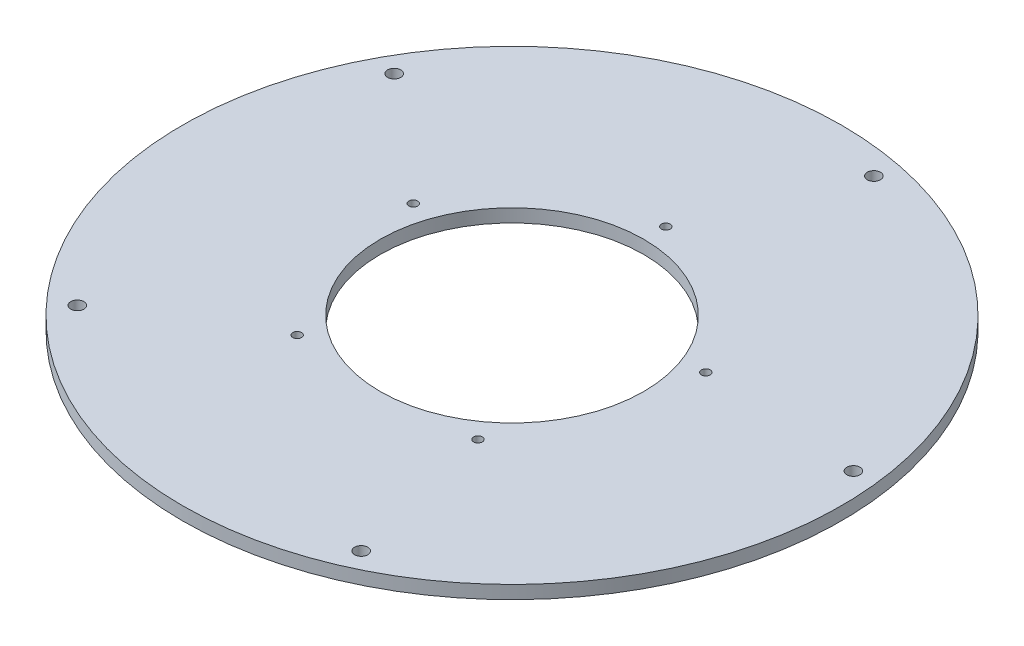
ISO-10303-21;
HEADER;
FILE_DESCRIPTION(('STEP AP214'),'2;1');
FILE_NAME('part.step','',(''),(''),'','','');
FILE_SCHEMA(('AUTOMOTIVE_DESIGN { 1 0 10303 214 1 1 1 1 }'));
ENDSEC;
DATA;
#1=APPLICATION_CONTEXT('core data for automotive mechanical design processes');
#2=APPLICATION_PROTOCOL_DEFINITION('international standard','automotive_design',2000,#1);
#3=PRODUCT_CONTEXT('',#1,'mechanical');
#4=PRODUCT('Part','Part','',(#3));
#5=PRODUCT_RELATED_PRODUCT_CATEGORY('part','',(#4));
#6=PRODUCT_DEFINITION_FORMATION('','',#4);
#7=PRODUCT_DEFINITION_CONTEXT('part definition',#1,'design');
#8=PRODUCT_DEFINITION('design','',#6,#7);
#9=PRODUCT_DEFINITION_SHAPE('','',#8);
#10=(LENGTH_UNIT() NAMED_UNIT(*) SI_UNIT(.MILLI.,.METRE.));
#11=(NAMED_UNIT(*) PLANE_ANGLE_UNIT() SI_UNIT($,.RADIAN.));
#12=(NAMED_UNIT(*) SI_UNIT($,.STERADIAN.) SOLID_ANGLE_UNIT());
#13=UNCERTAINTY_MEASURE_WITH_UNIT(LENGTH_MEASURE(1.E-05),#10,'distance_accuracy_value','');
#14=(GEOMETRIC_REPRESENTATION_CONTEXT(3) GLOBAL_UNCERTAINTY_ASSIGNED_CONTEXT((#13)) GLOBAL_UNIT_ASSIGNED_CONTEXT((#10,
#11,#12)) REPRESENTATION_CONTEXT('',''));
#15=CARTESIAN_POINT('',(0.,0.,0.));
#16=DIRECTION('',(0.,0.,1.));
#17=DIRECTION('',(1.,0.,0.));
#18=AXIS2_PLACEMENT_3D('',#15,#16,#17);
#19=CARTESIAN_POINT('',(0.,3.,0.));
#20=DIRECTION('',(0.,1.,0.));
#21=DIRECTION('',(0.,0.,1.));
#22=AXIS2_PLACEMENT_3D('',#19,#20,#21);
#23=PLANE('',#22);
#24=CARTESIAN_POINT('',(-33.2869780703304,3.,-10.8155948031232));
#25=DIRECTION('',(0.,1.,0.));
#26=DIRECTION('',(0.,0.,1.));
#27=AXIS2_PLACEMENT_3D('',#24,#25,#26);
#28=CIRCLE('',#27,1.00000000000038);
#29=CARTESIAN_POINT('',(-33.2869780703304,3.,-9.81559480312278));
#30=VERTEX_POINT('',#29);
#31=EDGE_CURVE('E95',#30,#30,#28,.T.);
#32=ORIENTED_EDGE('',*,*,#31,.F.);
#33=EDGE_LOOP('',(#32));
#34=FACE_BOUND('',#33,.T.);
#35=CARTESIAN_POINT('',(-20.5724838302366,3.,28.3155948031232));
#36=DIRECTION('',(0.,1.,0.));
#37=DIRECTION('',(0.,0.,1.));
#38=AXIS2_PLACEMENT_3D('',#35,#36,#37);
#39=CIRCLE('',#38,1.0000000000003);
#40=CARTESIAN_POINT('',(-20.5724838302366,3.,29.3155948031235));
#41=VERTEX_POINT('',#40);
#42=EDGE_CURVE('E83',#41,#41,#39,.T.);
#43=ORIENTED_EDGE('',*,*,#42,.F.);
#44=EDGE_LOOP('',(#43));
#45=FACE_BOUND('',#44,.T.);
#46=CARTESIAN_POINT('',(20.5724838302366,3.,28.3155948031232));
#47=DIRECTION('',(0.,1.,0.));
#48=DIRECTION('',(0.,0.,1.));
#49=AXIS2_PLACEMENT_3D('',#46,#47,#48);
#50=CIRCLE('',#49,1.0000000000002);
#51=CARTESIAN_POINT('',(20.5724838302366,3.,29.3155948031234));
#52=VERTEX_POINT('',#51);
#53=EDGE_CURVE('E71',#52,#52,#50,.T.);
#54=ORIENTED_EDGE('',*,*,#53,.F.);
#55=EDGE_LOOP('',(#54));
#56=FACE_BOUND('',#55,.T.);
#57=CARTESIAN_POINT('',(33.2869780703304,3.,-10.8155948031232));
#58=DIRECTION('',(0.,1.,0.));
#59=DIRECTION('',(0.,0.,1.));
#60=AXIS2_PLACEMENT_3D('',#57,#58,#59);
#61=CIRCLE('',#60,1.00000000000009);
#62=CARTESIAN_POINT('',(33.2869780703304,3.,-9.81559480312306));
#63=VERTEX_POINT('',#62);
#64=EDGE_CURVE('E59',#63,#63,#61,.T.);
#65=ORIENTED_EDGE('',*,*,#64,.F.);
#66=EDGE_LOOP('',(#65));
#67=FACE_BOUND('',#66,.T.);
#68=CARTESIAN_POINT('',(0.,3.,-35.));
#69=DIRECTION('',(0.,1.,0.));
#70=DIRECTION('',(0.,0.,1.));
#71=AXIS2_PLACEMENT_3D('',#68,#69,#70);
#72=CIRCLE('',#71,1.);
#73=CARTESIAN_POINT('',(0.,3.,-34.));
#74=VERTEX_POINT('',#73);
#75=EDGE_CURVE('E47',#74,#74,#72,.T.);
#76=ORIENTED_EDGE('',*,*,#75,.F.);
#77=EDGE_LOOP('',(#76));
#78=FACE_BOUND('',#77,.T.);
#79=CARTESIAN_POINT('',(0.,3.,0.));
#80=DIRECTION('',(0.,1.,0.));
#81=DIRECTION('',(0.,0.,1.));
#82=AXIS2_PLACEMENT_3D('',#79,#80,#81);
#83=CIRCLE('',#82,75.);
#84=CARTESIAN_POINT('',(0.,3.,75.));
#85=VERTEX_POINT('',#84);
#86=EDGE_CURVE('E10',#85,#85,#83,.T.);
#87=ORIENTED_EDGE('',*,*,#86,.T.);
#88=EDGE_LOOP('',(#87));
#89=FACE_BOUND('',#88,.T.);
#90=CARTESIAN_POINT('',(0.,3.,0.));
#91=DIRECTION('',(0.,1.,0.));
#92=DIRECTION('',(0.,0.,1.));
#93=AXIS2_PLACEMENT_3D('',#90,#91,#92);
#94=CIRCLE('',#93,30.);
#95=CARTESIAN_POINT('',(0.,3.,30.));
#96=VERTEX_POINT('',#95);
#97=EDGE_CURVE('E42',#96,#96,#94,.T.);
#98=ORIENTED_EDGE('',*,*,#97,.F.);
#99=EDGE_LOOP('',(#98));
#100=FACE_BOUND('',#99,.T.);
#101=CARTESIAN_POINT('',(13.7,3.,-68.6462671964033));
#102=DIRECTION('',(0.,1.,0.));
#103=DIRECTION('',(0.,0.,1.));
#104=AXIS2_PLACEMENT_3D('',#101,#102,#103);
#105=CIRCLE('',#104,1.5);
#106=CARTESIAN_POINT('',(13.7,3.,-67.1462671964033));
#107=VERTEX_POINT('',#106);
#108=EDGE_CURVE('E53',#107,#107,#105,.T.);
#109=ORIENTED_EDGE('',*,*,#108,.F.);
#110=EDGE_LOOP('',(#109));
#111=FACE_BOUND('',#110,.T.);
#112=CARTESIAN_POINT('',(69.5200125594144,3.,-8.18338889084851));
#113=DIRECTION('',(0.,1.,0.));
#114=DIRECTION('',(0.,0.,1.));
#115=AXIS2_PLACEMENT_3D('',#112,#113,#114);
#116=CIRCLE('',#115,1.5);
#117=CARTESIAN_POINT('',(69.5200125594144,3.,-6.68338889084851));
#118=VERTEX_POINT('',#117);
#119=EDGE_CURVE('E65',#118,#118,#116,.T.);
#120=ORIENTED_EDGE('',*,*,#119,.F.);
#121=EDGE_LOOP('',(#120));
#122=FACE_BOUND('',#121,.T.);
#123=CARTESIAN_POINT('',(29.2657306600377,3.,63.5886547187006));
#124=DIRECTION('',(0.,1.,0.));
#125=DIRECTION('',(0.,0.,1.));
#126=AXIS2_PLACEMENT_3D('',#123,#124,#125);
#127=CIRCLE('',#126,1.5);
#128=CARTESIAN_POINT('',(29.2657306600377,3.,65.0886547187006));
#129=VERTEX_POINT('',#128);
#130=EDGE_CURVE('E77',#129,#129,#127,.T.);
#131=ORIENTED_EDGE('',*,*,#130,.F.);
#132=EDGE_LOOP('',(#131));
#133=FACE_BOUND('',#132,.T.);
#134=CARTESIAN_POINT('',(-51.4327963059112,3.,47.4833388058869));
#135=DIRECTION('',(0.,1.,0.));
#136=DIRECTION('',(0.,0.,1.));
#137=AXIS2_PLACEMENT_3D('',#134,#135,#136);
#138=CIRCLE('',#137,1.5);
#139=CARTESIAN_POINT('',(-51.4327963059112,3.,48.9833388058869));
#140=VERTEX_POINT('',#139);
#141=EDGE_CURVE('E89',#140,#140,#138,.T.);
#142=ORIENTED_EDGE('',*,*,#141,.F.);
#143=EDGE_LOOP('',(#142));
#144=FACE_BOUND('',#143,.T.);
#145=CARTESIAN_POINT('',(-61.0529469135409,3.,-34.2423374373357));
#146=DIRECTION('',(0.,1.,0.));
#147=DIRECTION('',(0.,0.,1.));
#148=AXIS2_PLACEMENT_3D('',#145,#146,#147);
#149=CIRCLE('',#148,1.5);
#150=CARTESIAN_POINT('',(-61.0529469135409,3.,-32.7423374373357));
#151=VERTEX_POINT('',#150);
#152=EDGE_CURVE('E101',#151,#151,#149,.T.);
#153=ORIENTED_EDGE('',*,*,#152,.F.);
#154=EDGE_LOOP('',(#153));
#155=FACE_BOUND('',#154,.T.);
#156=ADVANCED_FACE('F31',(#34,#45,#56,#67,#78,#89,#100,#111,#122,#133,#144,#155),#23,.T.);
#157=CARTESIAN_POINT('',(0.,0.,0.));
#158=DIRECTION('',(0.,1.,0.));
#159=DIRECTION('',(0.,0.,1.));
#160=AXIS2_PLACEMENT_3D('',#157,#158,#159);
#161=PLANE('',#160);
#162=CARTESIAN_POINT('',(-33.2869780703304,0.,-10.8155948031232));
#163=DIRECTION('',(0.,1.,0.));
#164=DIRECTION('',(0.,0.,1.));
#165=AXIS2_PLACEMENT_3D('',#162,#163,#164);
#166=CIRCLE('',#165,1.00000000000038);
#167=CARTESIAN_POINT('',(-33.2869780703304,0.,-9.81559480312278));
#168=VERTEX_POINT('',#167);
#169=EDGE_CURVE('E98',#168,#168,#166,.T.);
#170=ORIENTED_EDGE('',*,*,#169,.T.);
#171=EDGE_LOOP('',(#170));
#172=FACE_BOUND('',#171,.T.);
#173=CARTESIAN_POINT('',(-20.5724838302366,0.,28.3155948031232));
#174=DIRECTION('',(0.,1.,0.));
#175=DIRECTION('',(0.,0.,1.));
#176=AXIS2_PLACEMENT_3D('',#173,#174,#175);
#177=CIRCLE('',#176,1.0000000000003);
#178=CARTESIAN_POINT('',(-20.5724838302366,0.,29.3155948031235));
#179=VERTEX_POINT('',#178);
#180=EDGE_CURVE('E86',#179,#179,#177,.T.);
#181=ORIENTED_EDGE('',*,*,#180,.T.);
#182=EDGE_LOOP('',(#181));
#183=FACE_BOUND('',#182,.T.);
#184=CARTESIAN_POINT('',(20.5724838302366,0.,28.3155948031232));
#185=DIRECTION('',(0.,1.,0.));
#186=DIRECTION('',(0.,0.,1.));
#187=AXIS2_PLACEMENT_3D('',#184,#185,#186);
#188=CIRCLE('',#187,1.0000000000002);
#189=CARTESIAN_POINT('',(20.5724838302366,0.,29.3155948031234));
#190=VERTEX_POINT('',#189);
#191=EDGE_CURVE('E74',#190,#190,#188,.T.);
#192=ORIENTED_EDGE('',*,*,#191,.T.);
#193=EDGE_LOOP('',(#192));
#194=FACE_BOUND('',#193,.T.);
#195=CARTESIAN_POINT('',(33.2869780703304,0.,-10.8155948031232));
#196=DIRECTION('',(0.,1.,0.));
#197=DIRECTION('',(0.,0.,1.));
#198=AXIS2_PLACEMENT_3D('',#195,#196,#197);
#199=CIRCLE('',#198,1.00000000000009);
#200=CARTESIAN_POINT('',(33.2869780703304,0.,-9.81559480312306));
#201=VERTEX_POINT('',#200);
#202=EDGE_CURVE('E62',#201,#201,#199,.T.);
#203=ORIENTED_EDGE('',*,*,#202,.T.);
#204=EDGE_LOOP('',(#203));
#205=FACE_BOUND('',#204,.T.);
#206=CARTESIAN_POINT('',(0.,0.,-35.));
#207=DIRECTION('',(0.,1.,0.));
#208=DIRECTION('',(0.,0.,1.));
#209=AXIS2_PLACEMENT_3D('',#206,#207,#208);
#210=CIRCLE('',#209,1.);
#211=CARTESIAN_POINT('',(0.,0.,-34.));
#212=VERTEX_POINT('',#211);
#213=EDGE_CURVE('E50',#212,#212,#210,.T.);
#214=ORIENTED_EDGE('',*,*,#213,.T.);
#215=EDGE_LOOP('',(#214));
#216=FACE_BOUND('',#215,.T.);
#217=CARTESIAN_POINT('',(0.,0.,0.));
#218=DIRECTION('',(0.,1.,0.));
#219=DIRECTION('',(0.,0.,1.));
#220=AXIS2_PLACEMENT_3D('',#217,#218,#219);
#221=CIRCLE('',#220,75.);
#222=CARTESIAN_POINT('',(0.,0.,75.));
#223=VERTEX_POINT('',#222);
#224=EDGE_CURVE('E35',#223,#223,#221,.T.);
#225=ORIENTED_EDGE('',*,*,#224,.F.);
#226=EDGE_LOOP('',(#225));
#227=FACE_BOUND('',#226,.T.);
#228=CARTESIAN_POINT('',(0.,0.,0.));
#229=DIRECTION('',(0.,1.,0.));
#230=DIRECTION('',(0.,0.,1.));
#231=AXIS2_PLACEMENT_3D('',#228,#229,#230);
#232=CIRCLE('',#231,30.);
#233=CARTESIAN_POINT('',(0.,0.,30.));
#234=VERTEX_POINT('',#233);
#235=EDGE_CURVE('E44',#234,#234,#232,.T.);
#236=ORIENTED_EDGE('',*,*,#235,.T.);
#237=EDGE_LOOP('',(#236));
#238=FACE_BOUND('',#237,.T.);
#239=CARTESIAN_POINT('',(13.7,0.,-68.6462671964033));
#240=DIRECTION('',(0.,1.,0.));
#241=DIRECTION('',(0.,0.,1.));
#242=AXIS2_PLACEMENT_3D('',#239,#240,#241);
#243=CIRCLE('',#242,1.5);
#244=CARTESIAN_POINT('',(13.7,0.,-67.1462671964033));
#245=VERTEX_POINT('',#244);
#246=EDGE_CURVE('E56',#245,#245,#243,.T.);
#247=ORIENTED_EDGE('',*,*,#246,.T.);
#248=EDGE_LOOP('',(#247));
#249=FACE_BOUND('',#248,.T.);
#250=CARTESIAN_POINT('',(69.5200125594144,0.,-8.18338889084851));
#251=DIRECTION('',(0.,1.,0.));
#252=DIRECTION('',(0.,0.,1.));
#253=AXIS2_PLACEMENT_3D('',#250,#251,#252);
#254=CIRCLE('',#253,1.5);
#255=CARTESIAN_POINT('',(69.5200125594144,0.,-6.68338889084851));
#256=VERTEX_POINT('',#255);
#257=EDGE_CURVE('E68',#256,#256,#254,.T.);
#258=ORIENTED_EDGE('',*,*,#257,.T.);
#259=EDGE_LOOP('',(#258));
#260=FACE_BOUND('',#259,.T.);
#261=CARTESIAN_POINT('',(29.2657306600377,0.,63.5886547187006));
#262=DIRECTION('',(0.,1.,0.));
#263=DIRECTION('',(0.,0.,1.));
#264=AXIS2_PLACEMENT_3D('',#261,#262,#263);
#265=CIRCLE('',#264,1.5);
#266=CARTESIAN_POINT('',(29.2657306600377,0.,65.0886547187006));
#267=VERTEX_POINT('',#266);
#268=EDGE_CURVE('E80',#267,#267,#265,.T.);
#269=ORIENTED_EDGE('',*,*,#268,.T.);
#270=EDGE_LOOP('',(#269));
#271=FACE_BOUND('',#270,.T.);
#272=CARTESIAN_POINT('',(-51.4327963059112,0.,47.4833388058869));
#273=DIRECTION('',(0.,1.,0.));
#274=DIRECTION('',(0.,0.,1.));
#275=AXIS2_PLACEMENT_3D('',#272,#273,#274);
#276=CIRCLE('',#275,1.5);
#277=CARTESIAN_POINT('',(-51.4327963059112,0.,48.9833388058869));
#278=VERTEX_POINT('',#277);
#279=EDGE_CURVE('E92',#278,#278,#276,.T.);
#280=ORIENTED_EDGE('',*,*,#279,.T.);
#281=EDGE_LOOP('',(#280));
#282=FACE_BOUND('',#281,.T.);
#283=CARTESIAN_POINT('',(-61.0529469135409,0.,-34.2423374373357));
#284=DIRECTION('',(0.,1.,0.));
#285=DIRECTION('',(0.,0.,1.));
#286=AXIS2_PLACEMENT_3D('',#283,#284,#285);
#287=CIRCLE('',#286,1.5);
#288=CARTESIAN_POINT('',(-61.0529469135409,0.,-32.7423374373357));
#289=VERTEX_POINT('',#288);
#290=EDGE_CURVE('E104',#289,#289,#287,.T.);
#291=ORIENTED_EDGE('',*,*,#290,.T.);
#292=EDGE_LOOP('',(#291));
#293=FACE_BOUND('',#292,.T.);
#294=ADVANCED_FACE('F114',(#172,#183,#194,#205,#216,#227,#238,#249,#260,#271,#282,#293),#161,.F.);
#295=CARTESIAN_POINT('',(0.,3.,0.));
#296=DIRECTION('',(0.,-1.,0.));
#297=DIRECTION('',(0.,0.,-1.));
#298=AXIS2_PLACEMENT_3D('',#295,#296,#297);
#299=CYLINDRICAL_SURFACE('',#298,75.);
#300=ORIENTED_EDGE('',*,*,#86,.F.);
#301=EDGE_LOOP('',(#300));
#302=FACE_BOUND('',#301,.T.);
#303=ORIENTED_EDGE('',*,*,#224,.T.);
#304=EDGE_LOOP('',(#303));
#305=FACE_BOUND('',#304,.T.);
#306=ADVANCED_FACE('F33',(#302,#305),#299,.T.);
#307=CARTESIAN_POINT('',(0.,3.,0.));
#308=DIRECTION('',(0.,-1.,0.));
#309=DIRECTION('',(0.,0.,-1.));
#310=AXIS2_PLACEMENT_3D('',#307,#308,#309);
#311=CYLINDRICAL_SURFACE('',#310,30.);
#312=ORIENTED_EDGE('',*,*,#97,.T.);
#313=EDGE_LOOP('',(#312));
#314=FACE_BOUND('',#313,.T.);
#315=ORIENTED_EDGE('',*,*,#235,.F.);
#316=EDGE_LOOP('',(#315));
#317=FACE_BOUND('',#316,.T.);
#318=ADVANCED_FACE('F124',(#314,#317),#311,.F.);
#319=CARTESIAN_POINT('',(0.,3.,-35.));
#320=DIRECTION('',(0.,-1.,0.));
#321=DIRECTION('',(0.,0.,-1.));
#322=AXIS2_PLACEMENT_3D('',#319,#320,#321);
#323=CYLINDRICAL_SURFACE('',#322,1.);
#324=ORIENTED_EDGE('',*,*,#75,.T.);
#325=EDGE_LOOP('',(#324));
#326=FACE_BOUND('',#325,.T.);
#327=ORIENTED_EDGE('',*,*,#213,.F.);
#328=EDGE_LOOP('',(#327));
#329=FACE_BOUND('',#328,.T.);
#330=ADVANCED_FACE('F127',(#326,#329),#323,.F.);
#331=CARTESIAN_POINT('',(13.7,3.,-68.6462671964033));
#332=DIRECTION('',(0.,-1.,0.));
#333=DIRECTION('',(0.,0.,-1.));
#334=AXIS2_PLACEMENT_3D('',#331,#332,#333);
#335=CYLINDRICAL_SURFACE('',#334,1.5);
#336=ORIENTED_EDGE('',*,*,#108,.T.);
#337=EDGE_LOOP('',(#336));
#338=FACE_BOUND('',#337,.T.);
#339=ORIENTED_EDGE('',*,*,#246,.F.);
#340=EDGE_LOOP('',(#339));
#341=FACE_BOUND('',#340,.T.);
#342=ADVANCED_FACE('F131',(#338,#341),#335,.F.);
#343=CARTESIAN_POINT('',(33.2869780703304,3.,-10.8155948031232));
#344=DIRECTION('',(0.,-1.,0.));
#345=DIRECTION('',(0.,0.,-1.));
#346=AXIS2_PLACEMENT_3D('',#343,#344,#345);
#347=CYLINDRICAL_SURFACE('',#346,1.00000000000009);
#348=ORIENTED_EDGE('',*,*,#64,.T.);
#349=EDGE_LOOP('',(#348));
#350=FACE_BOUND('',#349,.T.);
#351=ORIENTED_EDGE('',*,*,#202,.F.);
#352=EDGE_LOOP('',(#351));
#353=FACE_BOUND('',#352,.T.);
#354=ADVANCED_FACE('F135',(#350,#353),#347,.F.);
#355=CARTESIAN_POINT('',(69.5200125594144,3.,-8.18338889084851));
#356=DIRECTION('',(0.,-1.,0.));
#357=DIRECTION('',(0.,0.,-1.));
#358=AXIS2_PLACEMENT_3D('',#355,#356,#357);
#359=CYLINDRICAL_SURFACE('',#358,1.5);
#360=ORIENTED_EDGE('',*,*,#119,.T.);
#361=EDGE_LOOP('',(#360));
#362=FACE_BOUND('',#361,.T.);
#363=ORIENTED_EDGE('',*,*,#257,.F.);
#364=EDGE_LOOP('',(#363));
#365=FACE_BOUND('',#364,.T.);
#366=ADVANCED_FACE('F139',(#362,#365),#359,.F.);
#367=CARTESIAN_POINT('',(20.5724838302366,3.,28.3155948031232));
#368=DIRECTION('',(0.,-1.,0.));
#369=DIRECTION('',(0.,0.,-1.));
#370=AXIS2_PLACEMENT_3D('',#367,#368,#369);
#371=CYLINDRICAL_SURFACE('',#370,1.0000000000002);
#372=ORIENTED_EDGE('',*,*,#53,.T.);
#373=EDGE_LOOP('',(#372));
#374=FACE_BOUND('',#373,.T.);
#375=ORIENTED_EDGE('',*,*,#191,.F.);
#376=EDGE_LOOP('',(#375));
#377=FACE_BOUND('',#376,.T.);
#378=ADVANCED_FACE('F143',(#374,#377),#371,.F.);
#379=CARTESIAN_POINT('',(29.2657306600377,3.,63.5886547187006));
#380=DIRECTION('',(0.,-1.,0.));
#381=DIRECTION('',(0.,0.,-1.));
#382=AXIS2_PLACEMENT_3D('',#379,#380,#381);
#383=CYLINDRICAL_SURFACE('',#382,1.5);
#384=ORIENTED_EDGE('',*,*,#130,.T.);
#385=EDGE_LOOP('',(#384));
#386=FACE_BOUND('',#385,.T.);
#387=ORIENTED_EDGE('',*,*,#268,.F.);
#388=EDGE_LOOP('',(#387));
#389=FACE_BOUND('',#388,.T.);
#390=ADVANCED_FACE('F147',(#386,#389),#383,.F.);
#391=CARTESIAN_POINT('',(-20.5724838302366,3.,28.3155948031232));
#392=DIRECTION('',(0.,-1.,0.));
#393=DIRECTION('',(0.,0.,-1.));
#394=AXIS2_PLACEMENT_3D('',#391,#392,#393);
#395=CYLINDRICAL_SURFACE('',#394,1.0000000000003);
#396=ORIENTED_EDGE('',*,*,#42,.T.);
#397=EDGE_LOOP('',(#396));
#398=FACE_BOUND('',#397,.T.);
#399=ORIENTED_EDGE('',*,*,#180,.F.);
#400=EDGE_LOOP('',(#399));
#401=FACE_BOUND('',#400,.T.);
#402=ADVANCED_FACE('F151',(#398,#401),#395,.F.);
#403=CARTESIAN_POINT('',(-51.4327963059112,3.,47.4833388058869));
#404=DIRECTION('',(0.,-1.,0.));
#405=DIRECTION('',(0.,0.,-1.));
#406=AXIS2_PLACEMENT_3D('',#403,#404,#405);
#407=CYLINDRICAL_SURFACE('',#406,1.5);
#408=ORIENTED_EDGE('',*,*,#141,.T.);
#409=EDGE_LOOP('',(#408));
#410=FACE_BOUND('',#409,.T.);
#411=ORIENTED_EDGE('',*,*,#279,.F.);
#412=EDGE_LOOP('',(#411));
#413=FACE_BOUND('',#412,.T.);
#414=ADVANCED_FACE('F155',(#410,#413),#407,.F.);
#415=CARTESIAN_POINT('',(-33.2869780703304,3.,-10.8155948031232));
#416=DIRECTION('',(0.,-1.,0.));
#417=DIRECTION('',(0.,0.,-1.));
#418=AXIS2_PLACEMENT_3D('',#415,#416,#417);
#419=CYLINDRICAL_SURFACE('',#418,1.00000000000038);
#420=ORIENTED_EDGE('',*,*,#31,.T.);
#421=EDGE_LOOP('',(#420));
#422=FACE_BOUND('',#421,.T.);
#423=ORIENTED_EDGE('',*,*,#169,.F.);
#424=EDGE_LOOP('',(#423));
#425=FACE_BOUND('',#424,.T.);
#426=ADVANCED_FACE('F159',(#422,#425),#419,.F.);
#427=CARTESIAN_POINT('',(-61.0529469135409,3.,-34.2423374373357));
#428=DIRECTION('',(0.,-1.,0.));
#429=DIRECTION('',(0.,0.,-1.));
#430=AXIS2_PLACEMENT_3D('',#427,#428,#429);
#431=CYLINDRICAL_SURFACE('',#430,1.5);
#432=ORIENTED_EDGE('',*,*,#152,.T.);
#433=EDGE_LOOP('',(#432));
#434=FACE_BOUND('',#433,.T.);
#435=ORIENTED_EDGE('',*,*,#290,.F.);
#436=EDGE_LOOP('',(#435));
#437=FACE_BOUND('',#436,.T.);
#438=ADVANCED_FACE('F110',(#434,#437),#431,.F.);
#439=CLOSED_SHELL('',(#156,#294,#306,#318,#330,#342,#354,#366,#378,#390,#402,#414,#426,#438));
#440=MANIFOLD_SOLID_BREP('B2',#439);
#441=ADVANCED_BREP_SHAPE_REPRESENTATION('',(#18,#440),#14);
#442=SHAPE_DEFINITION_REPRESENTATION(#9,#441);
ENDSEC;
END-ISO-10303-21;
